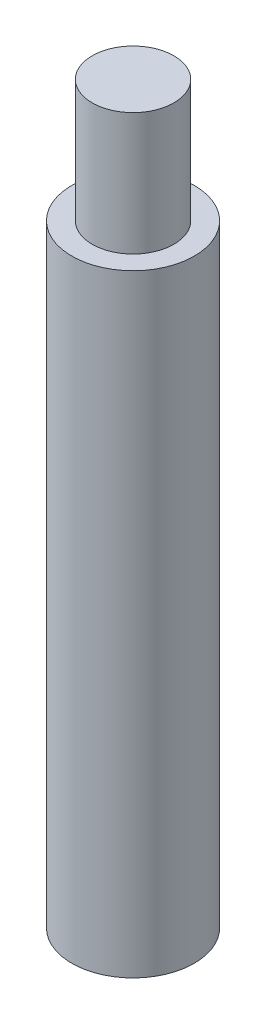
from build123d import *


with BuildPart() as part:
    # Esquisse1 → R_volution1 (revolve)
    with BuildSketch(Plane.XY, mode=Mode.PRIVATE) as r_volution1_sk:
        Polygon((0, 0), (1.5, 0), (1.5, 15), (1, 15), (1, 18), (0, 18), align=None)
    revolve(r_volution1_sk.sketch.rotate(Axis((0, -2.22085852, 0), (0, 1, 0)), 90), axis=Axis((0, -2.22085852, 0), (0, 1, 0)))


solid = part.part
